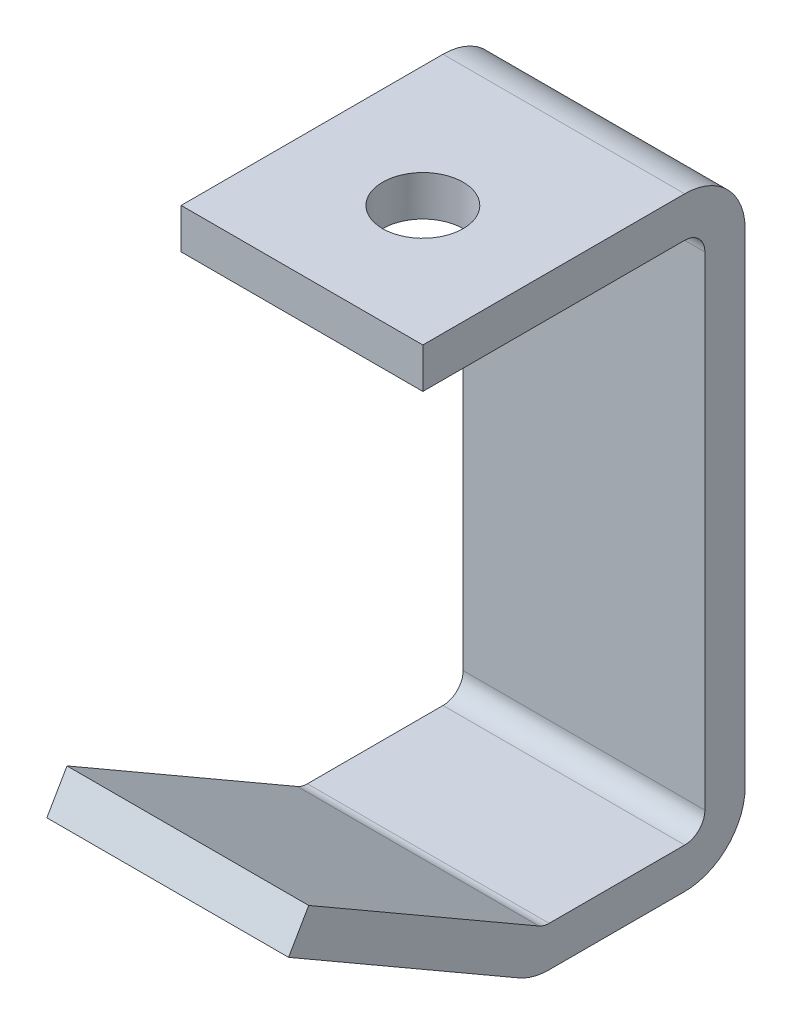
from build123d import *

# Parameters (mm, degrees)
BASE_EXTRUDE_THIN_DEPTH = 19.05
CUT_EXTRUDE1_REACH      = 119.223
SKETCH2_R               = 6.35


with BuildPart() as part:
    # Sketch1 → Base-Extrude-Thin (new, symmetric)
    with BuildSketch(Plane(origin=(0, 0, 0), x_dir=(0, 0, -1), z_dir=(1, 0, 0))):
        with BuildLine():
            Line((-62.443024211, 21.3868), (-26.136761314, 0.425369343))
            ThreePointArc((-26.136761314, 0.425369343), (-25.371011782, 0.108185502), (-24.549261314, 0))
            Line((-24.549261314, 0), (-3.175, 0))
            ThreePointArc((-3.175, 0), (-0.92993597, 0.92993597), (0, 3.175))
            Line((0, 3.175), (0, 79.375))
            ThreePointArc((0, 79.375), (-0.92993597, 81.62006403), (-3.175, 82.55))
            Line((-3.175, 82.55), (-44.45, 82.55))
            Line((-44.45, 82.55), (-44.45, 88.9))
            Line((-44.45, 88.9), (-3.175, 88.9))
            ThreePointArc((-3.175, 88.9), (3.560192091, 86.110192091), (6.35, 79.375))
            Line((6.35, 79.375), (6.35, 3.175))
            ThreePointArc((6.35, 3.175), (3.560192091, -3.560192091), (-3.175, -6.35))
            Line((-3.175, -6.35), (-24.549261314, -6.35))
            ThreePointArc((-24.549261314, -6.35), (-27.014512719, -6.025443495), (-29.311761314, -5.073891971))
            Line((-29.311761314, -5.073891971), (-65.618024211, 15.887538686))
            Line((-65.618024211, 15.887538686), (-62.443024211, 21.3868))
        make_face()
    extrude(amount=BASE_EXTRUDE_THIN_DEPTH, both=True)

    # Sketch2 → Cut-Extrude1 (cut, up to next)
    with BuildSketch(Plane(origin=(0, 88.9, 0), x_dir=(-1, 0, 0), z_dir=(0, 1, 0)), mode=Mode.PRIVATE) as cut_extrude1_sk1:
        with Locations(Location((0, 25.4, 0), (0, 0, 90))):
            Circle(SKETCH2_R)
    cut_extrude1_tool1 = extrude(cut_extrude1_sk1.sketch, amount=-CUT_EXTRUDE1_REACH, mode=Mode.PRIVATE) & part.part
    add(cut_extrude1_tool1.solids().sort_by_distance((0, 88.9, 25.4))[0], mode=Mode.SUBTRACT)


solid = part.part
